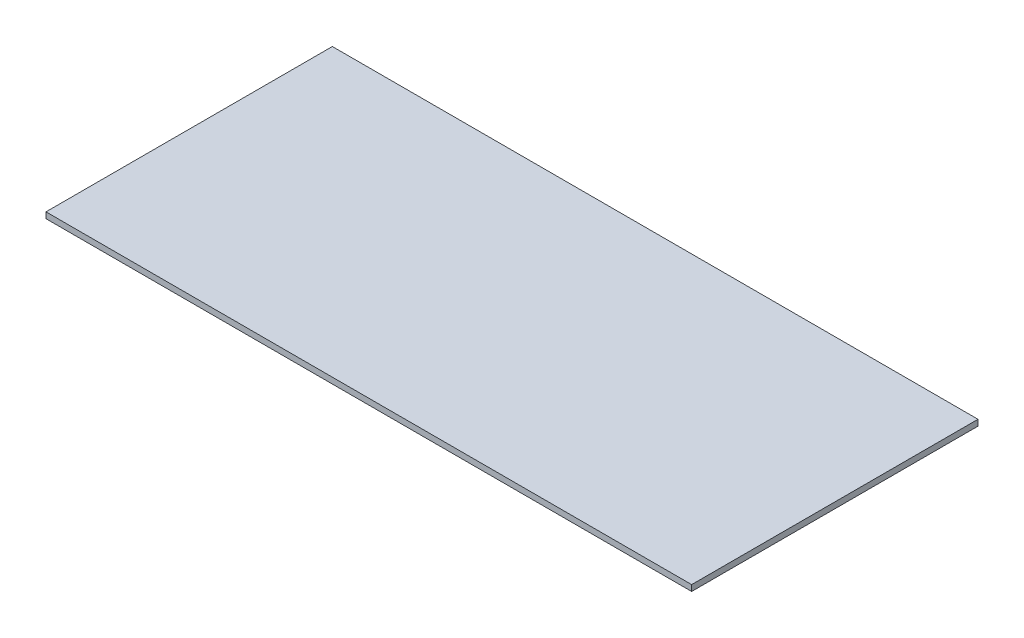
ISO-10303-21;
HEADER;
FILE_DESCRIPTION(('STEP AP214'),'2;1');
FILE_NAME('part.step','',(''),(''),'','','');
FILE_SCHEMA(('AUTOMOTIVE_DESIGN { 1 0 10303 214 1 1 1 1 }'));
ENDSEC;
DATA;
#1=APPLICATION_CONTEXT('core data for automotive mechanical design processes');
#2=APPLICATION_PROTOCOL_DEFINITION('international standard','automotive_design',2000,#1);
#3=PRODUCT_CONTEXT('',#1,'mechanical');
#4=PRODUCT('Part','Part','',(#3));
#5=PRODUCT_RELATED_PRODUCT_CATEGORY('part','',(#4));
#6=PRODUCT_DEFINITION_FORMATION('','',#4);
#7=PRODUCT_DEFINITION_CONTEXT('part definition',#1,'design');
#8=PRODUCT_DEFINITION('design','',#6,#7);
#9=PRODUCT_DEFINITION_SHAPE('','',#8);
#10=(LENGTH_UNIT() NAMED_UNIT(*) SI_UNIT(.MILLI.,.METRE.));
#11=(NAMED_UNIT(*) PLANE_ANGLE_UNIT() SI_UNIT($,.RADIAN.));
#12=(NAMED_UNIT(*) SI_UNIT($,.STERADIAN.) SOLID_ANGLE_UNIT());
#13=UNCERTAINTY_MEASURE_WITH_UNIT(LENGTH_MEASURE(1.E-05),#10,'distance_accuracy_value','');
#14=(GEOMETRIC_REPRESENTATION_CONTEXT(3) GLOBAL_UNCERTAINTY_ASSIGNED_CONTEXT((#13)) GLOBAL_UNIT_ASSIGNED_CONTEXT((#10,
#11,#12)) REPRESENTATION_CONTEXT('',''));
#15=CARTESIAN_POINT('',(0.,0.,0.));
#16=DIRECTION('',(0.,0.,1.));
#17=DIRECTION('',(1.,0.,0.));
#18=AXIS2_PLACEMENT_3D('',#15,#16,#17);
#19=CARTESIAN_POINT('',(0.,-12.7,0.));
#20=DIRECTION('',(-1.,0.,0.));
#21=DIRECTION('',(0.,0.,1.));
#22=AXIS2_PLACEMENT_3D('',#19,#20,#21);
#23=PLANE('',#22);
#24=DIRECTION('',(0.,0.,1.));
#25=VECTOR('',#24,1.);
#26=CARTESIAN_POINT('',(0.,0.,0.));
#27=LINE('',#26,#25);
#28=CARTESIAN_POINT('',(0.,0.,-608.33));
#29=VERTEX_POINT('',#28);
#30=CARTESIAN_POINT('',(0.,0.,0.));
#31=VERTEX_POINT('',#30);
#32=EDGE_CURVE('E94',#29,#31,#27,.T.);
#33=ORIENTED_EDGE('',*,*,#32,.F.);
#34=DIRECTION('',(0.,1.,0.));
#35=VECTOR('',#34,1.);
#36=CARTESIAN_POINT('',(0.,-12.7,-608.33));
#37=LINE('',#36,#35);
#38=CARTESIAN_POINT('',(0.,-12.7,-608.33));
#39=VERTEX_POINT('',#38);
#40=EDGE_CURVE('E11',#39,#29,#37,.T.);
#41=ORIENTED_EDGE('',*,*,#40,.F.);
#42=DIRECTION('',(0.,0.,1.));
#43=VECTOR('',#42,1.);
#44=CARTESIAN_POINT('',(0.,-12.7,0.));
#45=LINE('',#44,#43);
#46=CARTESIAN_POINT('',(0.,-12.7,0.));
#47=VERTEX_POINT('',#46);
#48=EDGE_CURVE('E88',#39,#47,#45,.T.);
#49=ORIENTED_EDGE('',*,*,#48,.T.);
#50=DIRECTION('',(0.,1.,0.));
#51=VECTOR('',#50,1.);
#52=CARTESIAN_POINT('',(0.,-12.7,0.));
#53=LINE('',#52,#51);
#54=EDGE_CURVE('E33',#47,#31,#53,.T.);
#55=ORIENTED_EDGE('',*,*,#54,.T.);
#56=EDGE_LOOP('',(#33,#41,#49,#55));
#57=FACE_BOUND('',#56,.T.);
#58=ADVANCED_FACE('F30',(#57),#23,.T.);
#59=CARTESIAN_POINT('',(0.,-12.7,-608.33));
#60=DIRECTION('',(0.,0.,-1.));
#61=DIRECTION('',(-1.,0.,0.));
#62=AXIS2_PLACEMENT_3D('',#59,#60,#61);
#63=PLANE('',#62);
#64=DIRECTION('',(-1.,0.,0.));
#65=VECTOR('',#64,1.);
#66=CARTESIAN_POINT('',(0.,0.,-608.33));
#67=LINE('',#66,#65);
#68=CARTESIAN_POINT('',(1371.6,0.,-608.33));
#69=VERTEX_POINT('',#68);
#70=EDGE_CURVE('E90',#69,#29,#67,.T.);
#71=ORIENTED_EDGE('',*,*,#70,.F.);
#72=DIRECTION('',(0.,1.,0.));
#73=VECTOR('',#72,1.);
#74=CARTESIAN_POINT('',(1371.6,-12.7,-608.33));
#75=LINE('',#74,#73);
#76=CARTESIAN_POINT('',(1371.6,-12.7,-608.33));
#77=VERTEX_POINT('',#76);
#78=EDGE_CURVE('E39',#77,#69,#75,.T.);
#79=ORIENTED_EDGE('',*,*,#78,.F.);
#80=DIRECTION('',(-1.,0.,0.));
#81=VECTOR('',#80,1.);
#82=CARTESIAN_POINT('',(0.,-12.7,-608.33));
#83=LINE('',#82,#81);
#84=EDGE_CURVE('E85',#77,#39,#83,.T.);
#85=ORIENTED_EDGE('',*,*,#84,.T.);
#86=ORIENTED_EDGE('',*,*,#40,.T.);
#87=EDGE_LOOP('',(#71,#79,#85,#86));
#88=FACE_BOUND('',#87,.T.);
#89=ADVANCED_FACE('F104',(#88),#63,.T.);
#90=CARTESIAN_POINT('',(1371.6,-12.7,0.));
#91=DIRECTION('',(1.,0.,0.));
#92=DIRECTION('',(0.,0.,-1.));
#93=AXIS2_PLACEMENT_3D('',#90,#91,#92);
#94=PLANE('',#93);
#95=DIRECTION('',(0.,0.,-1.));
#96=VECTOR('',#95,1.);
#97=CARTESIAN_POINT('',(1371.6,0.,0.));
#98=LINE('',#97,#96);
#99=CARTESIAN_POINT('',(1371.6,0.,0.));
#100=VERTEX_POINT('',#99);
#101=EDGE_CURVE('E80',#100,#69,#98,.T.);
#102=ORIENTED_EDGE('',*,*,#101,.F.);
#103=DIRECTION('',(0.,1.,0.));
#104=VECTOR('',#103,1.);
#105=CARTESIAN_POINT('',(1371.6,-12.7,0.));
#106=LINE('',#105,#104);
#107=CARTESIAN_POINT('',(1371.6,-12.7,0.));
#108=VERTEX_POINT('',#107);
#109=EDGE_CURVE('E75',#108,#100,#106,.T.);
#110=ORIENTED_EDGE('',*,*,#109,.F.);
#111=DIRECTION('',(0.,0.,-1.));
#112=VECTOR('',#111,1.);
#113=CARTESIAN_POINT('',(1371.6,-12.7,0.));
#114=LINE('',#113,#112);
#115=EDGE_CURVE('E78',#108,#77,#114,.T.);
#116=ORIENTED_EDGE('',*,*,#115,.T.);
#117=ORIENTED_EDGE('',*,*,#78,.T.);
#118=EDGE_LOOP('',(#102,#110,#116,#117));
#119=FACE_BOUND('',#118,.T.);
#120=ADVANCED_FACE('F77',(#119),#94,.T.);
#121=CARTESIAN_POINT('',(0.,-12.7,0.));
#122=DIRECTION('',(0.,0.,1.));
#123=DIRECTION('',(1.,0.,0.));
#124=AXIS2_PLACEMENT_3D('',#121,#122,#123);
#125=PLANE('',#124);
#126=DIRECTION('',(1.,0.,0.));
#127=VECTOR('',#126,1.);
#128=CARTESIAN_POINT('',(0.,0.,0.));
#129=LINE('',#128,#127);
#130=EDGE_CURVE('E97',#31,#100,#129,.T.);
#131=ORIENTED_EDGE('',*,*,#130,.F.);
#132=ORIENTED_EDGE('',*,*,#54,.F.);
#133=DIRECTION('',(1.,0.,0.));
#134=VECTOR('',#133,1.);
#135=CARTESIAN_POINT('',(0.,-12.7,0.));
#136=LINE('',#135,#134);
#137=EDGE_CURVE('E84',#47,#108,#136,.T.);
#138=ORIENTED_EDGE('',*,*,#137,.T.);
#139=ORIENTED_EDGE('',*,*,#109,.T.);
#140=EDGE_LOOP('',(#131,#132,#138,#139));
#141=FACE_BOUND('',#140,.T.);
#142=ADVANCED_FACE('F87',(#141),#125,.T.);
#143=CARTESIAN_POINT('',(0.,-12.7,-608.33));
#144=DIRECTION('',(0.,-1.,0.));
#145=DIRECTION('',(0.,0.,-1.));
#146=AXIS2_PLACEMENT_3D('',#143,#144,#145);
#147=PLANE('',#146);
#148=ORIENTED_EDGE('',*,*,#48,.F.);
#149=ORIENTED_EDGE('',*,*,#84,.F.);
#150=ORIENTED_EDGE('',*,*,#115,.F.);
#151=ORIENTED_EDGE('',*,*,#137,.F.);
#152=EDGE_LOOP('',(#148,#149,#150,#151));
#153=FACE_BOUND('',#152,.T.);
#154=ADVANCED_FACE('F83',(#153),#147,.T.);
#155=CARTESIAN_POINT('',(0.,0.,-608.33));
#156=DIRECTION('',(0.,-1.,0.));
#157=DIRECTION('',(0.,0.,-1.));
#158=AXIS2_PLACEMENT_3D('',#155,#156,#157);
#159=PLANE('',#158);
#160=ORIENTED_EDGE('',*,*,#32,.T.);
#161=ORIENTED_EDGE('',*,*,#130,.T.);
#162=ORIENTED_EDGE('',*,*,#101,.T.);
#163=ORIENTED_EDGE('',*,*,#70,.T.);
#164=EDGE_LOOP('',(#160,#161,#162,#163));
#165=FACE_BOUND('',#164,.T.);
#166=ADVANCED_FACE('F103',(#165),#159,.F.);
#167=CLOSED_SHELL('',(#58,#89,#120,#142,#154,#166));
#168=MANIFOLD_SOLID_BREP('B2',#167);
#169=ADVANCED_BREP_SHAPE_REPRESENTATION('',(#18,#168),#14);
#170=SHAPE_DEFINITION_REPRESENTATION(#9,#169);
ENDSEC;
END-ISO-10303-21;
